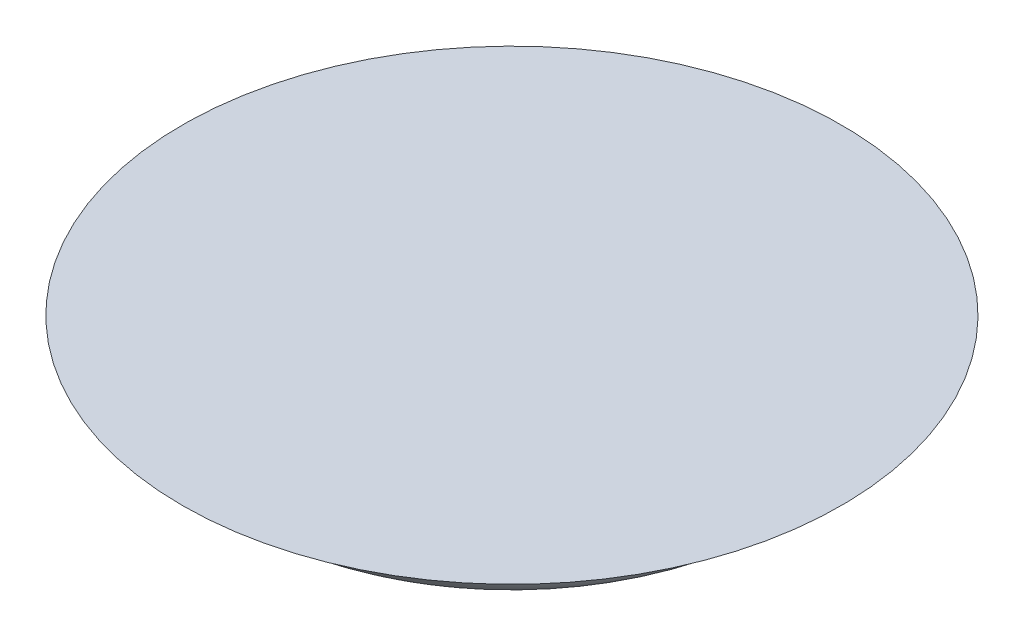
ISO-10303-21;
HEADER;
FILE_DESCRIPTION(('STEP AP214'),'2;1');
FILE_NAME('part.step','',(''),(''),'','','');
FILE_SCHEMA(('AUTOMOTIVE_DESIGN { 1 0 10303 214 1 1 1 1 }'));
ENDSEC;
DATA;
#1=APPLICATION_CONTEXT('core data for automotive mechanical design processes');
#2=APPLICATION_PROTOCOL_DEFINITION('international standard','automotive_design',2000,#1);
#3=PRODUCT_CONTEXT('',#1,'mechanical');
#4=PRODUCT('Part','Part','',(#3));
#5=PRODUCT_RELATED_PRODUCT_CATEGORY('part','',(#4));
#6=PRODUCT_DEFINITION_FORMATION('','',#4);
#7=PRODUCT_DEFINITION_CONTEXT('part definition',#1,'design');
#8=PRODUCT_DEFINITION('design','',#6,#7);
#9=PRODUCT_DEFINITION_SHAPE('','',#8);
#10=(LENGTH_UNIT() NAMED_UNIT(*) SI_UNIT(.MILLI.,.METRE.));
#11=(NAMED_UNIT(*) PLANE_ANGLE_UNIT() SI_UNIT($,.RADIAN.));
#12=(NAMED_UNIT(*) SI_UNIT($,.STERADIAN.) SOLID_ANGLE_UNIT());
#13=UNCERTAINTY_MEASURE_WITH_UNIT(LENGTH_MEASURE(1.E-05),#10,'distance_accuracy_value','');
#14=(GEOMETRIC_REPRESENTATION_CONTEXT(3) GLOBAL_UNCERTAINTY_ASSIGNED_CONTEXT((#13)) GLOBAL_UNIT_ASSIGNED_CONTEXT((#10,
#11,#12)) REPRESENTATION_CONTEXT('',''));
#15=CARTESIAN_POINT('',(0.,0.,0.));
#16=DIRECTION('',(0.,0.,1.));
#17=DIRECTION('',(1.,0.,0.));
#18=AXIS2_PLACEMENT_3D('',#15,#16,#17);
#19=CARTESIAN_POINT('',(0.,-5.,0.));
#20=DIRECTION('',(0.,-1.,0.));
#21=DIRECTION('',(0.,0.,-1.));
#22=AXIS2_PLACEMENT_3D('',#19,#20,#21);
#23=PLANE('',#22);
#24=CARTESIAN_POINT('',(0.,-5.,0.));
#25=DIRECTION('',(0.,-1.,0.));
#26=DIRECTION('',(0.,0.,-1.));
#27=AXIS2_PLACEMENT_3D('',#24,#25,#26);
#28=CIRCLE('',#27,22.);
#29=CARTESIAN_POINT('',(0.,-5.,-22.));
#30=VERTEX_POINT('',#29);
#31=EDGE_CURVE('E38',#30,#30,#28,.T.);
#32=ORIENTED_EDGE('',*,*,#31,.T.);
#33=EDGE_LOOP('',(#32));
#34=FACE_BOUND('',#33,.T.);
#35=ADVANCED_FACE('F32',(#34),#23,.T.);
#36=CARTESIAN_POINT('',(0.,-2.,0.));
#37=DIRECTION('',(0.,-1.,0.));
#38=DIRECTION('',(0.,0.,-1.));
#39=AXIS2_PLACEMENT_3D('',#36,#37,#38);
#40=TOROIDAL_SURFACE('',#39,22.,3.);
#41=CARTESIAN_POINT('',(0.,-3.12499999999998,0.));
#42=DIRECTION('',(0.,1.,0.));
#43=DIRECTION('',(0.,0.,1.));
#44=AXIS2_PLACEMENT_3D('',#41,#42,#43);
#45=CIRCLE('',#44,24.7810744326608);
#46=CARTESIAN_POINT('',(0.,-3.12499999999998,24.7810744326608));
#47=VERTEX_POINT('',#46);
#48=EDGE_CURVE('E10',#47,#47,#45,.F.);
#49=ORIENTED_EDGE('',*,*,#48,.T.);
#50=EDGE_LOOP('',(#49));
#51=FACE_BOUND('',#50,.T.);
#52=ORIENTED_EDGE('',*,*,#31,.F.);
#53=EDGE_LOOP('',(#52));
#54=FACE_BOUND('',#53,.T.);
#55=ADVANCED_FACE('F58',(#51,#54),#40,.T.);
#56=CARTESIAN_POINT('',(0.,-5.,0.));
#57=DIRECTION('',(0.,1.,0.));
#58=DIRECTION('',(0.,0.,1.));
#59=AXIS2_PLACEMENT_3D('',#56,#57,#58);
#60=TOROIDAL_SURFACE('',#59,29.4161984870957,5.);
#61=CARTESIAN_POINT('',(0.,0.,0.));
#62=DIRECTION('',(0.,1.,0.));
#63=DIRECTION('',(0.,0.,1.));
#64=AXIS2_PLACEMENT_3D('',#61,#62,#63);
#65=CIRCLE('',#64,29.4161984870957);
#66=CARTESIAN_POINT('',(0.,0.,29.4161984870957));
#67=VERTEX_POINT('',#66);
#68=EDGE_CURVE('E42',#67,#67,#65,.F.);
#69=ORIENTED_EDGE('',*,*,#68,.T.);
#70=EDGE_LOOP('',(#69));
#71=FACE_BOUND('',#70,.T.);
#72=ORIENTED_EDGE('',*,*,#48,.F.);
#73=EDGE_LOOP('',(#72));
#74=FACE_BOUND('',#73,.T.);
#75=ADVANCED_FACE('F49',(#71,#74),#60,.F.);
#76=CARTESIAN_POINT('',(-101.845255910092,0.,60.));
#77=DIRECTION('',(0.,-1.,0.));
#78=DIRECTION('',(0.,0.,-1.));
#79=AXIS2_PLACEMENT_3D('',#76,#77,#78);
#80=PLANE('',#79);
#81=ORIENTED_EDGE('',*,*,#68,.F.);
#82=EDGE_LOOP('',(#81));
#83=FACE_BOUND('',#82,.T.);
#84=ADVANCED_FACE('F52',(#83),#80,.F.);
#85=CLOSED_SHELL('',(#35,#55,#75,#84));
#86=MANIFOLD_SOLID_BREP('B2',#85);
#87=ADVANCED_BREP_SHAPE_REPRESENTATION('',(#18,#86),#14);
#88=SHAPE_DEFINITION_REPRESENTATION(#9,#87);
ENDSEC;
END-ISO-10303-21;
